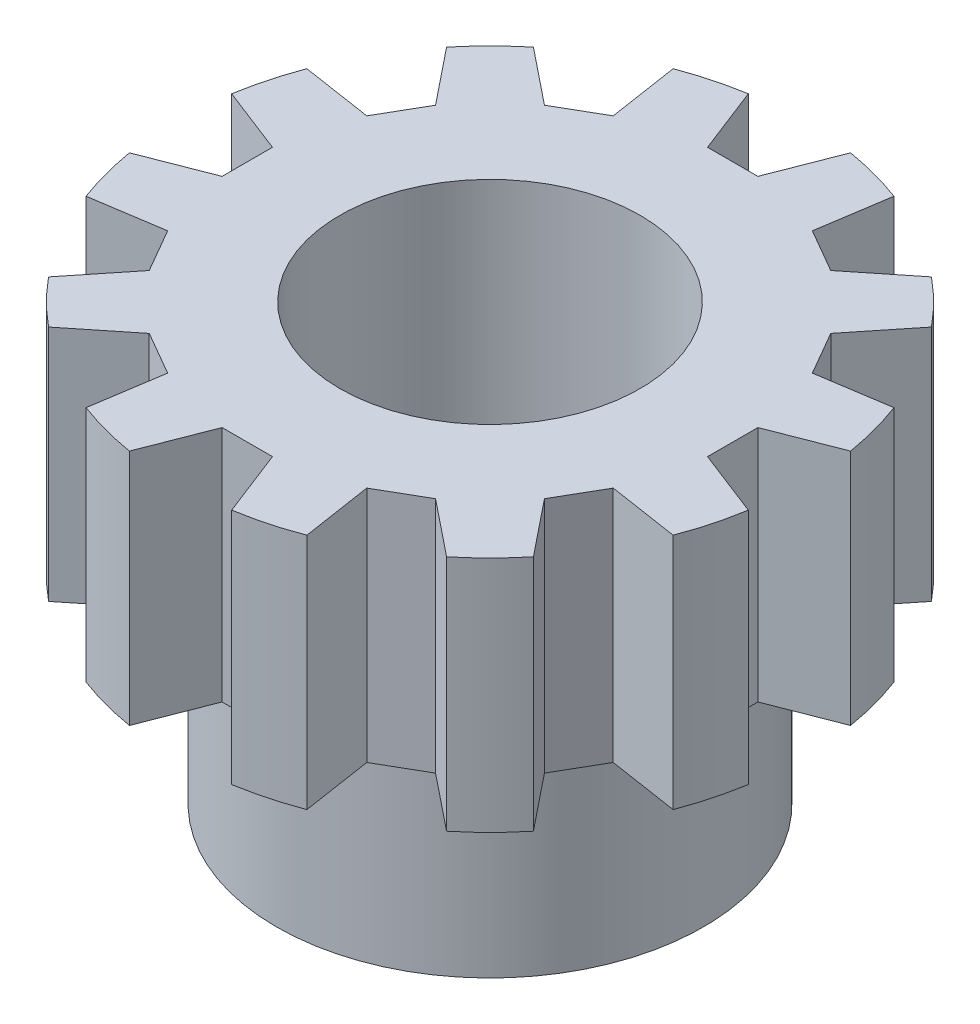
from build123d import *

# Parameters (mm, degrees)
CUT_EXTRUDE2_REACH = 19.55
CIRPATTERN1_COUNT  = 12


with BuildPart() as part:
    # Sketch1 → Revolve1 (revolve)
    with BuildSketch(Plane.XY, mode=Mode.PRIVATE) as revolve1_sk:
        Polygon((3.937, 47.625), (3.937, 55.894079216), (0.8255, 55.894079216), (0.8255, 51.371485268), (2.7305, 51.371485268), (2.7305, 47.625), align=None)
    revolve(revolve1_sk.sketch.rotate(Axis((6.7945, 45.4025, 0), (0, 1, 0)), 270), axis=Axis((6.7945, 45.4025, 0), (0, 1, 0)))

    # Sketch2 → Cut-Extrude2 (cut, up to next)
    with BuildSketch(Plane(origin=(-1.519613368, 55.894079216, 0), x_dir=(-1, 0, 0), z_dir=(0, 1, 0)), mode=Mode.PRIVATE) as cut_extrude2_sk1:
        with BuildLine():
            Line((-3.694980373, 0.479092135), (-2.424980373, 0.973177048))
            ThreePointArc((-2.424980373, 0.973177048), (-2.345113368, 0), (-2.424980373, -0.973177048))
            Line((-2.424980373, -0.973177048), (-3.694980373, -0.479092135))
            Line((-3.694980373, -0.479092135), (-3.694980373, 0.479092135))
        make_face()
    cut_extrude2_tool1 = extrude(cut_extrude2_sk1.sketch, amount=-CUT_EXTRUDE2_REACH, mode=Mode.PRIVATE) & part.part
    cut_extrude2 = cut_extrude2_tool1.solids().sort_by_distance((1.436663, 55.894079, 0))[0]
    add(cut_extrude2, mode=Mode.SUBTRACT)

    # CirPattern1: Cut-Extrude2 ×12 about axis
    cirpattern1_axis = Axis((6.7945, 0, 0), (0, 1, 0))
    for i in range(1, CIRPATTERN1_COUNT):
        add(cut_extrude2.rotate(cirpattern1_axis, i * 360 / CIRPATTERN1_COUNT), mode=Mode.SUBTRACT)


solid = part.part
